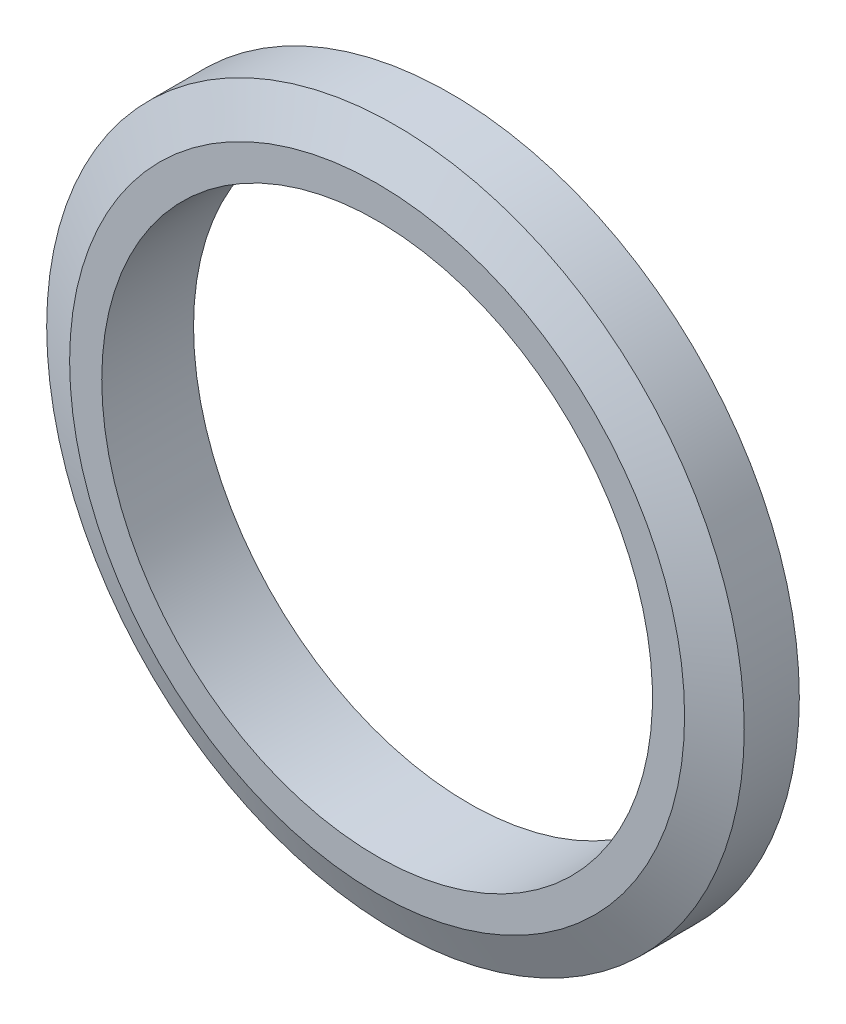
from build123d import *


with BuildPart() as part:
    # Sketch1 → Revolve1 (revolve)
    with BuildSketch(Plane.XZ.offset(-295), mode=Mode.PRIVATE) as revolve1_sk:
        Polygon((67.6, 15.4), (67.6, 16.6), (66.7, 17), (66, 17), (66, 15), (66.7, 15), align=None)
    revolve(revolve1_sk.sketch.rotate(Axis((60, 295, 17), (0, 0, -1)), 180), axis=Axis((60, 295, 17), (0, 0, -1)))


solid = part.part
